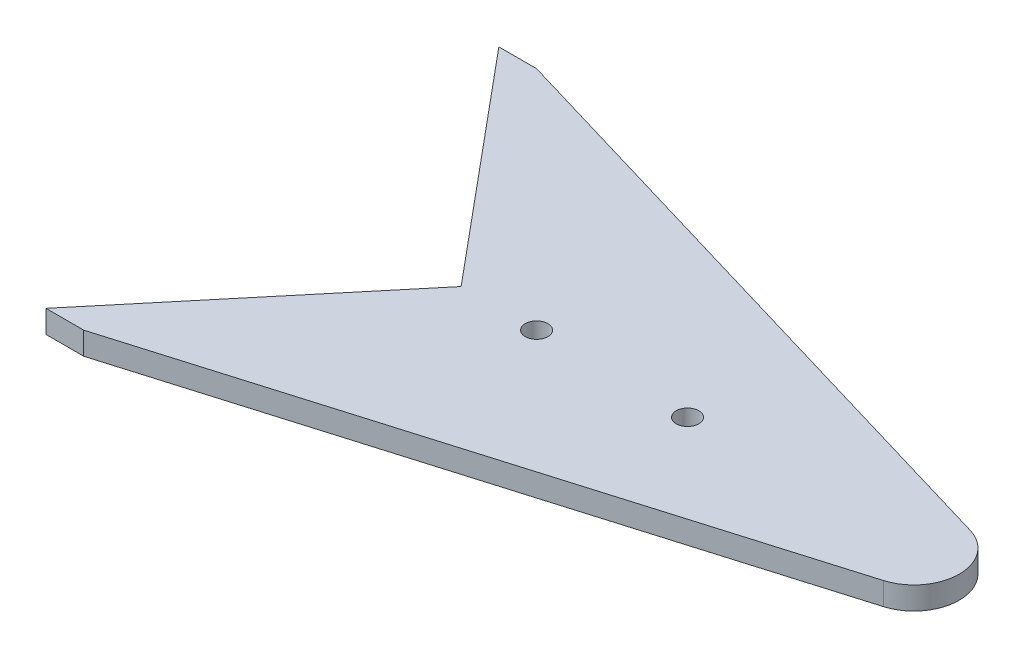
ISO-10303-21;
HEADER;
FILE_DESCRIPTION(('STEP AP214'),'2;1');
FILE_NAME('part.step','',(''),(''),'','','');
FILE_SCHEMA(('AUTOMOTIVE_DESIGN { 1 0 10303 214 1 1 1 1 }'));
ENDSEC;
DATA;
#1=APPLICATION_CONTEXT('core data for automotive mechanical design processes');
#2=APPLICATION_PROTOCOL_DEFINITION('international standard','automotive_design',2000,#1);
#3=PRODUCT_CONTEXT('',#1,'mechanical');
#4=PRODUCT('Part','Part','',(#3));
#5=PRODUCT_RELATED_PRODUCT_CATEGORY('part','',(#4));
#6=PRODUCT_DEFINITION_FORMATION('','',#4);
#7=PRODUCT_DEFINITION_CONTEXT('part definition',#1,'design');
#8=PRODUCT_DEFINITION('design','',#6,#7);
#9=PRODUCT_DEFINITION_SHAPE('','',#8);
#10=(LENGTH_UNIT() NAMED_UNIT(*) SI_UNIT(.MILLI.,.METRE.));
#11=(NAMED_UNIT(*) PLANE_ANGLE_UNIT() SI_UNIT($,.RADIAN.));
#12=(NAMED_UNIT(*) SI_UNIT($,.STERADIAN.) SOLID_ANGLE_UNIT());
#13=UNCERTAINTY_MEASURE_WITH_UNIT(LENGTH_MEASURE(1.E-05),#10,'distance_accuracy_value','');
#14=(GEOMETRIC_REPRESENTATION_CONTEXT(3) GLOBAL_UNCERTAINTY_ASSIGNED_CONTEXT((#13)) GLOBAL_UNIT_ASSIGNED_CONTEXT((#10,
#11,#12)) REPRESENTATION_CONTEXT('',''));
#15=CARTESIAN_POINT('',(0.,0.,0.));
#16=DIRECTION('',(0.,0.,1.));
#17=DIRECTION('',(1.,0.,0.));
#18=AXIS2_PLACEMENT_3D('',#15,#16,#17);
#19=CARTESIAN_POINT('',(85.,3.,0.));
#20=DIRECTION('',(0.,1.,0.));
#21=DIRECTION('',(0.,0.,1.));
#22=AXIS2_PLACEMENT_3D('',#19,#20,#21);
#23=PLANE('',#22);
#24=CARTESIAN_POINT('',(35.,3.,0.));
#25=DIRECTION('',(0.,1.,0.));
#26=DIRECTION('',(0.,0.,1.));
#27=AXIS2_PLACEMENT_3D('',#24,#25,#26);
#28=CIRCLE('',#27,1.5);
#29=CARTESIAN_POINT('',(35.,3.,1.5));
#30=VERTEX_POINT('',#29);
#31=EDGE_CURVE('E108',#30,#30,#28,.T.);
#32=ORIENTED_EDGE('',*,*,#31,.F.);
#33=EDGE_LOOP('',(#32));
#34=FACE_BOUND('',#33,.T.);
#35=DIRECTION('',(0.64018439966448,0.,0.768221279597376));
#36=VECTOR('',#35,1.);
#37=CARTESIAN_POINT('',(0.,3.,-30.));
#38=LINE('',#37,#36);
#39=CARTESIAN_POINT('',(0.,3.,-30.));
#40=VERTEX_POINT('',#39);
#41=CARTESIAN_POINT('',(25.,3.,0.));
#42=VERTEX_POINT('',#41);
#43=EDGE_CURVE('E124',#40,#42,#38,.T.);
#44=ORIENTED_EDGE('',*,*,#43,.T.);
#45=DIRECTION('',(-0.64018439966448,0.,0.768221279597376));
#46=VECTOR('',#45,1.);
#47=CARTESIAN_POINT('',(25.,3.,0.));
#48=LINE('',#47,#46);
#49=CARTESIAN_POINT('',(0.,3.,30.));
#50=VERTEX_POINT('',#49);
#51=EDGE_CURVE('E103',#42,#50,#48,.T.);
#52=ORIENTED_EDGE('',*,*,#51,.T.);
#53=DIRECTION('',(1.,0.,0.));
#54=VECTOR('',#53,1.);
#55=CARTESIAN_POINT('',(0.,3.,30.));
#56=LINE('',#55,#54);
#57=CARTESIAN_POINT('',(5.,3.,30.));
#58=VERTEX_POINT('',#57);
#59=EDGE_CURVE('E127',#50,#58,#56,.T.);
#60=ORIENTED_EDGE('',*,*,#59,.T.);
#61=DIRECTION('',(0.958675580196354,0.,-0.28450154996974));
#62=VECTOR('',#61,1.);
#63=CARTESIAN_POINT('',(5.,3.,30.));
#64=LINE('',#63,#62);
#65=CARTESIAN_POINT('',(86.7070500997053,3.,5.75219096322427));
#66=VERTEX_POINT('',#65);
#67=EDGE_CURVE('E129',#58,#66,#64,.T.);
#68=ORIENTED_EDGE('',*,*,#67,.T.);
#69=CARTESIAN_POINT('',(85.,3.,0.));
#70=DIRECTION('',(0.,1.,0.));
#71=DIRECTION('',(0.,0.,1.));
#72=AXIS2_PLACEMENT_3D('',#69,#70,#71);
#73=CIRCLE('',#72,6.00014340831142);
#74=CARTESIAN_POINT('',(86.7070500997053,3.,-5.75219096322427));
#75=VERTEX_POINT('',#74);
#76=EDGE_CURVE('E131',#66,#75,#73,.T.);
#77=ORIENTED_EDGE('',*,*,#76,.T.);
#78=DIRECTION('',(-0.958675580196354,0.,-0.28450154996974));
#79=VECTOR('',#78,1.);
#80=CARTESIAN_POINT('',(5.,3.,-30.));
#81=LINE('',#80,#79);
#82=CARTESIAN_POINT('',(5.,3.,-30.));
#83=VERTEX_POINT('',#82);
#84=EDGE_CURVE('E50',#75,#83,#81,.T.);
#85=ORIENTED_EDGE('',*,*,#84,.T.);
#86=DIRECTION('',(-1.,0.,0.));
#87=VECTOR('',#86,1.);
#88=CARTESIAN_POINT('',(0.,3.,-30.));
#89=LINE('',#88,#87);
#90=EDGE_CURVE('E45',#83,#40,#89,.T.);
#91=ORIENTED_EDGE('',*,*,#90,.T.);
#92=EDGE_LOOP('',(#44,#52,#60,#68,#77,#85,#91));
#93=FACE_BOUND('',#92,.T.);
#94=CARTESIAN_POINT('',(55.,3.,0.));
#95=DIRECTION('',(0.,1.,0.));
#96=DIRECTION('',(0.,0.,1.));
#97=AXIS2_PLACEMENT_3D('',#94,#95,#96);
#98=CIRCLE('',#97,1.5);
#99=CARTESIAN_POINT('',(55.,3.,1.5));
#100=VERTEX_POINT('',#99);
#101=EDGE_CURVE('E194',#100,#100,#98,.T.);
#102=ORIENTED_EDGE('',*,*,#101,.F.);
#103=EDGE_LOOP('',(#102));
#104=FACE_BOUND('',#103,.T.);
#105=ADVANCED_FACE('F30',(#34,#93,#104),#23,.T.);
#106=CARTESIAN_POINT('',(85.,0.,0.));
#107=DIRECTION('',(0.,1.,0.));
#108=DIRECTION('',(0.,0.,1.));
#109=AXIS2_PLACEMENT_3D('',#106,#107,#108);
#110=PLANE('',#109);
#111=CARTESIAN_POINT('',(35.,0.,0.));
#112=DIRECTION('',(0.,1.,0.));
#113=DIRECTION('',(0.,0.,1.));
#114=AXIS2_PLACEMENT_3D('',#111,#112,#113);
#115=CIRCLE('',#114,1.5);
#116=CARTESIAN_POINT('',(35.,0.,1.5));
#117=VERTEX_POINT('',#116);
#118=EDGE_CURVE('E111',#117,#117,#115,.T.);
#119=ORIENTED_EDGE('',*,*,#118,.T.);
#120=EDGE_LOOP('',(#119));
#121=FACE_BOUND('',#120,.T.);
#122=DIRECTION('',(0.64018439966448,0.,0.768221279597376));
#123=VECTOR('',#122,1.);
#124=CARTESIAN_POINT('',(0.,0.,-30.));
#125=LINE('',#124,#123);
#126=CARTESIAN_POINT('',(0.,0.,-30.));
#127=VERTEX_POINT('',#126);
#128=CARTESIAN_POINT('',(25.,0.,0.));
#129=VERTEX_POINT('',#128);
#130=EDGE_CURVE('E94',#127,#129,#125,.T.);
#131=ORIENTED_EDGE('',*,*,#130,.F.);
#132=DIRECTION('',(-1.,0.,0.));
#133=VECTOR('',#132,1.);
#134=CARTESIAN_POINT('',(0.,0.,-30.));
#135=LINE('',#134,#133);
#136=CARTESIAN_POINT('',(5.,0.,-30.));
#137=VERTEX_POINT('',#136);
#138=EDGE_CURVE('E122',#137,#127,#135,.T.);
#139=ORIENTED_EDGE('',*,*,#138,.F.);
#140=DIRECTION('',(-0.958675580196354,0.,-0.28450154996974));
#141=VECTOR('',#140,1.);
#142=CARTESIAN_POINT('',(5.,0.,-30.));
#143=LINE('',#142,#141);
#144=CARTESIAN_POINT('',(86.7070500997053,0.,-5.75219096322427));
#145=VERTEX_POINT('',#144);
#146=EDGE_CURVE('E120',#145,#137,#143,.T.);
#147=ORIENTED_EDGE('',*,*,#146,.F.);
#148=CARTESIAN_POINT('',(85.,0.,0.));
#149=DIRECTION('',(0.,1.,0.));
#150=DIRECTION('',(0.,0.,1.));
#151=AXIS2_PLACEMENT_3D('',#148,#149,#150);
#152=CIRCLE('',#151,6.00014340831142);
#153=CARTESIAN_POINT('',(86.7070500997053,0.,5.75219096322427));
#154=VERTEX_POINT('',#153);
#155=EDGE_CURVE('E118',#154,#145,#152,.T.);
#156=ORIENTED_EDGE('',*,*,#155,.F.);
#157=DIRECTION('',(0.958675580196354,0.,-0.28450154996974));
#158=VECTOR('',#157,1.);
#159=CARTESIAN_POINT('',(5.,0.,30.));
#160=LINE('',#159,#158);
#161=CARTESIAN_POINT('',(5.,0.,30.));
#162=VERTEX_POINT('',#161);
#163=EDGE_CURVE('E116',#162,#154,#160,.T.);
#164=ORIENTED_EDGE('',*,*,#163,.F.);
#165=DIRECTION('',(1.,0.,0.));
#166=VECTOR('',#165,1.);
#167=CARTESIAN_POINT('',(0.,0.,30.));
#168=LINE('',#167,#166);
#169=CARTESIAN_POINT('',(0.,0.,30.));
#170=VERTEX_POINT('',#169);
#171=EDGE_CURVE('E96',#170,#162,#168,.T.);
#172=ORIENTED_EDGE('',*,*,#171,.F.);
#173=DIRECTION('',(-0.64018439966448,0.,0.768221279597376));
#174=VECTOR('',#173,1.);
#175=CARTESIAN_POINT('',(25.,0.,0.));
#176=LINE('',#175,#174);
#177=EDGE_CURVE('E89',#129,#170,#176,.T.);
#178=ORIENTED_EDGE('',*,*,#177,.F.);
#179=EDGE_LOOP('',(#131,#139,#147,#156,#164,#172,#178));
#180=FACE_BOUND('',#179,.T.);
#181=CARTESIAN_POINT('',(55.,0.,0.));
#182=DIRECTION('',(0.,1.,0.));
#183=DIRECTION('',(0.,0.,1.));
#184=AXIS2_PLACEMENT_3D('',#181,#182,#183);
#185=CIRCLE('',#184,1.5);
#186=CARTESIAN_POINT('',(55.,0.,1.5));
#187=VERTEX_POINT('',#186);
#188=EDGE_CURVE('E197',#187,#187,#185,.T.);
#189=ORIENTED_EDGE('',*,*,#188,.T.);
#190=EDGE_LOOP('',(#189));
#191=FACE_BOUND('',#190,.T.);
#192=ADVANCED_FACE('F90',(#121,#180,#191),#110,.F.);
#193=CARTESIAN_POINT('',(0.,3.,-30.));
#194=DIRECTION('',(0.768221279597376,0.,-0.64018439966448));
#195=DIRECTION('',(-0.64018439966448,0.,-0.768221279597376));
#196=AXIS2_PLACEMENT_3D('',#193,#194,#195);
#197=PLANE('',#196);
#198=ORIENTED_EDGE('',*,*,#130,.T.);
#199=DIRECTION('',(0.,-1.,0.));
#200=VECTOR('',#199,1.);
#201=CARTESIAN_POINT('',(25.,3.,0.));
#202=LINE('',#201,#200);
#203=EDGE_CURVE('E11',#42,#129,#202,.T.);
#204=ORIENTED_EDGE('',*,*,#203,.F.);
#205=ORIENTED_EDGE('',*,*,#43,.F.);
#206=DIRECTION('',(0.,-1.,0.));
#207=VECTOR('',#206,1.);
#208=CARTESIAN_POINT('',(0.,3.,-30.));
#209=LINE('',#208,#207);
#210=EDGE_CURVE('E107',#40,#127,#209,.T.);
#211=ORIENTED_EDGE('',*,*,#210,.T.);
#212=EDGE_LOOP('',(#198,#204,#205,#211));
#213=FACE_BOUND('',#212,.T.);
#214=ADVANCED_FACE('F32',(#213),#197,.F.);
#215=CARTESIAN_POINT('',(25.,3.,0.));
#216=DIRECTION('',(0.768221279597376,0.,0.64018439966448));
#217=DIRECTION('',(0.64018439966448,0.,-0.768221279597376));
#218=AXIS2_PLACEMENT_3D('',#215,#216,#217);
#219=PLANE('',#218);
#220=ORIENTED_EDGE('',*,*,#177,.T.);
#221=DIRECTION('',(0.,-1.,0.));
#222=VECTOR('',#221,1.);
#223=CARTESIAN_POINT('',(0.,3.,30.));
#224=LINE('',#223,#222);
#225=EDGE_CURVE('E38',#50,#170,#224,.T.);
#226=ORIENTED_EDGE('',*,*,#225,.F.);
#227=ORIENTED_EDGE('',*,*,#51,.F.);
#228=ORIENTED_EDGE('',*,*,#203,.T.);
#229=EDGE_LOOP('',(#220,#226,#227,#228));
#230=FACE_BOUND('',#229,.T.);
#231=ADVANCED_FACE('F102',(#230),#219,.F.);
#232=CARTESIAN_POINT('',(0.,3.,30.));
#233=DIRECTION('',(0.,0.,-1.));
#234=DIRECTION('',(-1.,0.,0.));
#235=AXIS2_PLACEMENT_3D('',#232,#233,#234);
#236=PLANE('',#235);
#237=ORIENTED_EDGE('',*,*,#171,.T.);
#238=DIRECTION('',(0.,-1.,0.));
#239=VECTOR('',#238,1.);
#240=CARTESIAN_POINT('',(5.,3.,30.));
#241=LINE('',#240,#239);
#242=EDGE_CURVE('E145',#58,#162,#241,.T.);
#243=ORIENTED_EDGE('',*,*,#242,.F.);
#244=ORIENTED_EDGE('',*,*,#59,.F.);
#245=ORIENTED_EDGE('',*,*,#225,.T.);
#246=EDGE_LOOP('',(#237,#243,#244,#245));
#247=FACE_BOUND('',#246,.T.);
#248=ADVANCED_FACE('F149',(#247),#236,.F.);
#249=CARTESIAN_POINT('',(5.,3.,30.));
#250=DIRECTION('',(-0.28450154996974,0.,-0.958675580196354));
#251=DIRECTION('',(-0.958675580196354,0.,0.28450154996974));
#252=AXIS2_PLACEMENT_3D('',#249,#250,#251);
#253=PLANE('',#252);
#254=ORIENTED_EDGE('',*,*,#163,.T.);
#255=DIRECTION('',(0.,-1.,0.));
#256=VECTOR('',#255,1.);
#257=CARTESIAN_POINT('',(86.7070500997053,3.,5.75219096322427));
#258=LINE('',#257,#256);
#259=EDGE_CURVE('E142',#66,#154,#258,.T.);
#260=ORIENTED_EDGE('',*,*,#259,.F.);
#261=ORIENTED_EDGE('',*,*,#67,.F.);
#262=ORIENTED_EDGE('',*,*,#242,.T.);
#263=EDGE_LOOP('',(#254,#260,#261,#262));
#264=FACE_BOUND('',#263,.T.);
#265=ADVANCED_FACE('F157',(#264),#253,.F.);
#266=CARTESIAN_POINT('',(85.,3.,0.));
#267=DIRECTION('',(0.,-1.,0.));
#268=DIRECTION('',(0.,0.,-1.));
#269=AXIS2_PLACEMENT_3D('',#266,#267,#268);
#270=CYLINDRICAL_SURFACE('',#269,6.00014340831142);
#271=ORIENTED_EDGE('',*,*,#155,.T.);
#272=DIRECTION('',(0.,-1.,0.));
#273=VECTOR('',#272,1.);
#274=CARTESIAN_POINT('',(86.7070500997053,3.,-5.75219096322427));
#275=LINE('',#274,#273);
#276=EDGE_CURVE('E139',#75,#145,#275,.T.);
#277=ORIENTED_EDGE('',*,*,#276,.F.);
#278=ORIENTED_EDGE('',*,*,#76,.F.);
#279=ORIENTED_EDGE('',*,*,#259,.T.);
#280=EDGE_LOOP('',(#271,#277,#278,#279));
#281=FACE_BOUND('',#280,.T.);
#282=ADVANCED_FACE('F160',(#281),#270,.T.);
#283=CARTESIAN_POINT('',(5.,3.,-30.));
#284=DIRECTION('',(-0.28450154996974,0.,0.958675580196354));
#285=DIRECTION('',(0.958675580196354,0.,0.28450154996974));
#286=AXIS2_PLACEMENT_3D('',#283,#284,#285);
#287=PLANE('',#286);
#288=ORIENTED_EDGE('',*,*,#146,.T.);
#289=DIRECTION('',(0.,-1.,0.));
#290=VECTOR('',#289,1.);
#291=CARTESIAN_POINT('',(5.,3.,-30.));
#292=LINE('',#291,#290);
#293=EDGE_CURVE('E136',#83,#137,#292,.T.);
#294=ORIENTED_EDGE('',*,*,#293,.F.);
#295=ORIENTED_EDGE('',*,*,#84,.F.);
#296=ORIENTED_EDGE('',*,*,#276,.T.);
#297=EDGE_LOOP('',(#288,#294,#295,#296));
#298=FACE_BOUND('',#297,.T.);
#299=ADVANCED_FACE('F163',(#298),#287,.F.);
#300=CARTESIAN_POINT('',(0.,3.,-30.));
#301=DIRECTION('',(0.,0.,1.));
#302=DIRECTION('',(1.,0.,0.));
#303=AXIS2_PLACEMENT_3D('',#300,#301,#302);
#304=PLANE('',#303);
#305=ORIENTED_EDGE('',*,*,#138,.T.);
#306=ORIENTED_EDGE('',*,*,#210,.F.);
#307=ORIENTED_EDGE('',*,*,#90,.F.);
#308=ORIENTED_EDGE('',*,*,#293,.T.);
#309=EDGE_LOOP('',(#305,#306,#307,#308));
#310=FACE_BOUND('',#309,.T.);
#311=ADVANCED_FACE('F165',(#310),#304,.F.);
#312=CARTESIAN_POINT('',(35.,3.,0.));
#313=DIRECTION('',(0.,-1.,0.));
#314=DIRECTION('',(0.,0.,-1.));
#315=AXIS2_PLACEMENT_3D('',#312,#313,#314);
#316=CYLINDRICAL_SURFACE('',#315,1.5);
#317=ORIENTED_EDGE('',*,*,#31,.T.);
#318=EDGE_LOOP('',(#317));
#319=FACE_BOUND('',#318,.T.);
#320=ORIENTED_EDGE('',*,*,#118,.F.);
#321=EDGE_LOOP('',(#320));
#322=FACE_BOUND('',#321,.T.);
#323=ADVANCED_FACE('F167',(#319,#322),#316,.F.);
#324=CARTESIAN_POINT('',(55.,3.,0.));
#325=DIRECTION('',(0.,-1.,0.));
#326=DIRECTION('',(0.,0.,-1.));
#327=AXIS2_PLACEMENT_3D('',#324,#325,#326);
#328=CYLINDRICAL_SURFACE('',#327,1.5);
#329=ORIENTED_EDGE('',*,*,#101,.T.);
#330=EDGE_LOOP('',(#329));
#331=FACE_BOUND('',#330,.T.);
#332=ORIENTED_EDGE('',*,*,#188,.F.);
#333=EDGE_LOOP('',(#332));
#334=FACE_BOUND('',#333,.T.);
#335=ADVANCED_FACE('F173',(#331,#334),#328,.F.);
#336=CLOSED_SHELL('',(#105,#192,#214,#231,#248,#265,#282,#299,#311,#323,#335));
#337=MANIFOLD_SOLID_BREP('B2',#336);
#338=ADVANCED_BREP_SHAPE_REPRESENTATION('',(#18,#337),#14);
#339=SHAPE_DEFINITION_REPRESENTATION(#9,#338);
ENDSEC;
END-ISO-10303-21;
